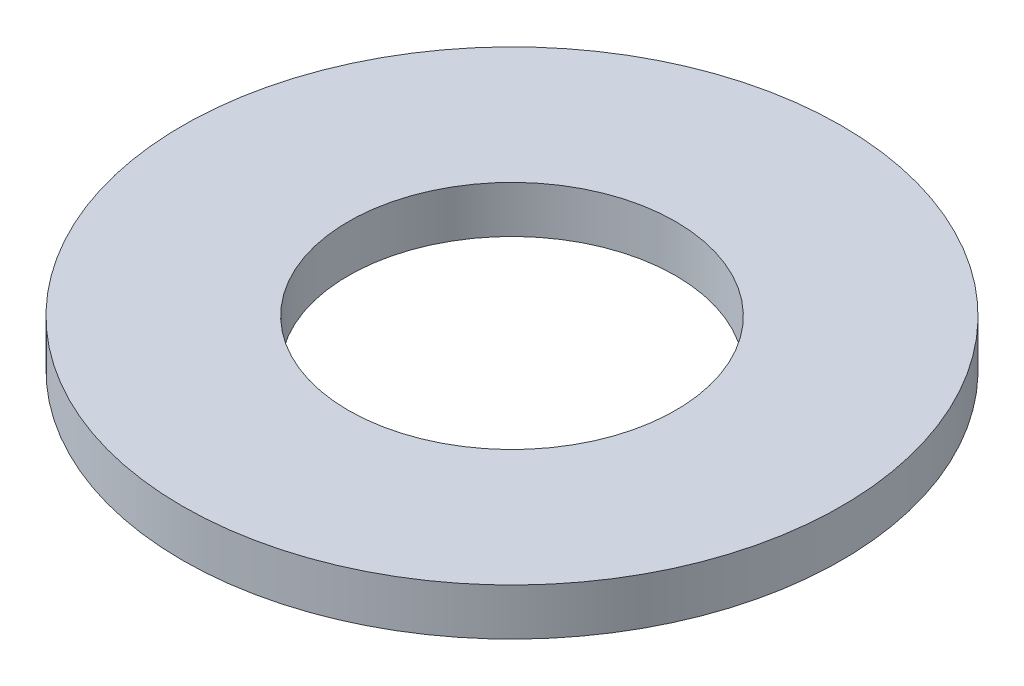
from build123d import *

# Parameters (mm, degrees)
SKETCH1_R           = 10.55
SKETCH1_R_2         = 5.237300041
BOSS_EXTRUDE1_DEPTH = 1.5


with BuildPart() as part:
    # Sketch1 → Boss-Extrude1 (new body)
    with BuildSketch(Plane(origin=(0, 0, 0), x_dir=(1, 0, 0), z_dir=(0, 1, 0))):
        with Locations(Location((0, 0, 0), (0, 0, 270))):
            Circle(SKETCH1_R)
        with Locations(Location((0, 0, 0), (0, 0, 270))):
            Circle(SKETCH1_R_2, mode=Mode.SUBTRACT)
    extrude(amount=BOSS_EXTRUDE1_DEPTH)


solid = part.part
